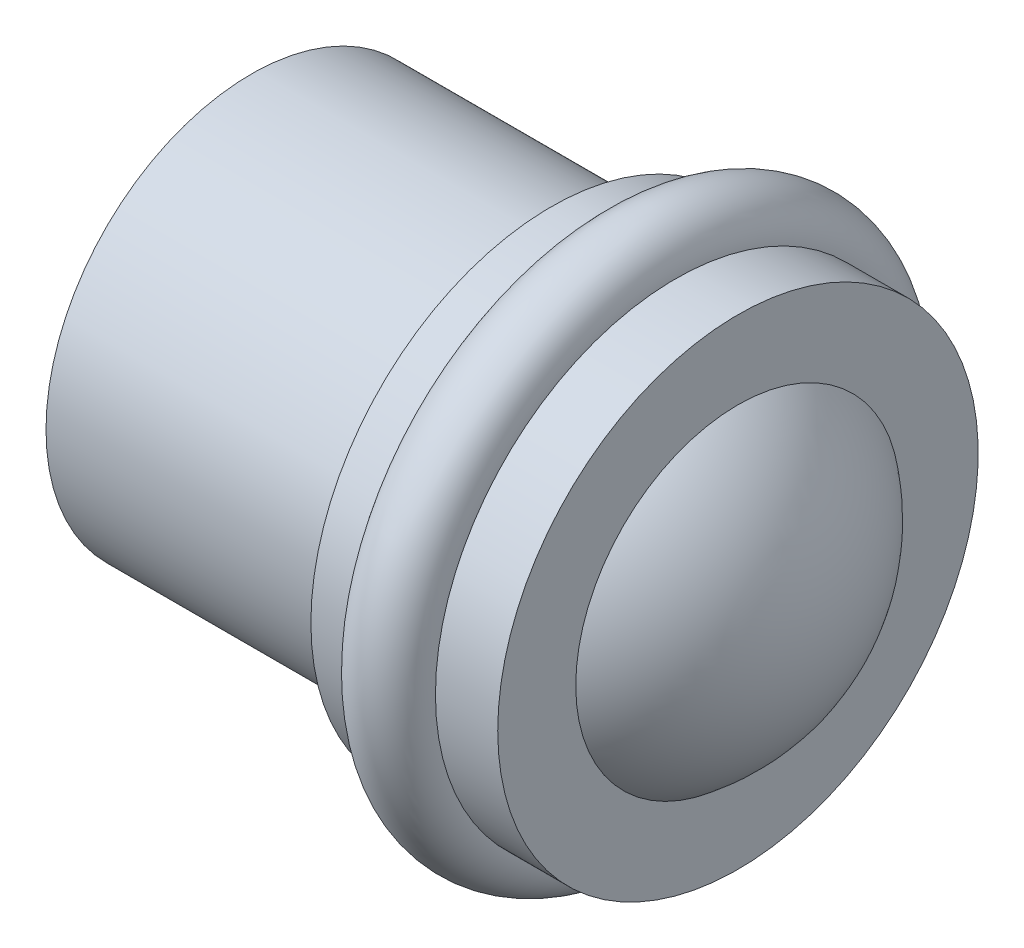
ISO-10303-21;
HEADER;
FILE_DESCRIPTION(('STEP AP214'),'2;1');
FILE_NAME('part.step','',(''),(''),'','','');
FILE_SCHEMA(('AUTOMOTIVE_DESIGN { 1 0 10303 214 1 1 1 1 }'));
ENDSEC;
DATA;
#1=APPLICATION_CONTEXT('core data for automotive mechanical design processes');
#2=APPLICATION_PROTOCOL_DEFINITION('international standard','automotive_design',2000,#1);
#3=PRODUCT_CONTEXT('',#1,'mechanical');
#4=PRODUCT('Part','Part','',(#3));
#5=PRODUCT_RELATED_PRODUCT_CATEGORY('part','',(#4));
#6=PRODUCT_DEFINITION_FORMATION('','',#4);
#7=PRODUCT_DEFINITION_CONTEXT('part definition',#1,'design');
#8=PRODUCT_DEFINITION('design','',#6,#7);
#9=PRODUCT_DEFINITION_SHAPE('','',#8);
#10=(LENGTH_UNIT() NAMED_UNIT(*) SI_UNIT(.MILLI.,.METRE.));
#11=(NAMED_UNIT(*) PLANE_ANGLE_UNIT() SI_UNIT($,.RADIAN.));
#12=(NAMED_UNIT(*) SI_UNIT($,.STERADIAN.) SOLID_ANGLE_UNIT());
#13=UNCERTAINTY_MEASURE_WITH_UNIT(LENGTH_MEASURE(1.E-05),#10,'distance_accuracy_value','');
#14=(GEOMETRIC_REPRESENTATION_CONTEXT(3) GLOBAL_UNCERTAINTY_ASSIGNED_CONTEXT((#13)) GLOBAL_UNIT_ASSIGNED_CONTEXT((#10,
#11,#12)) REPRESENTATION_CONTEXT('',''));
#15=CARTESIAN_POINT('',(0.,0.,0.));
#16=DIRECTION('',(0.,0.,1.));
#17=DIRECTION('',(1.,0.,0.));
#18=AXIS2_PLACEMENT_3D('',#15,#16,#17);
#19=CARTESIAN_POINT('',(1.26259166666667,0.,0.));
#20=DIRECTION('',(-1.,0.,0.));
#21=DIRECTION('',(0.,0.,1.));
#22=AXIS2_PLACEMENT_3D('',#19,#20,#21);
#23=TOROIDAL_SURFACE('',#22,2.97179999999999,0.481541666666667);
#24=CARTESIAN_POINT('',(1.26259166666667,0.,3.45334166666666));
#25=VERTEX_POINT('',#24);
#26=VERTEX_LOOP('',#25);
#27=FACE_BOUND('',#26,.T.);
#28=ADVANCED_FACE('F43',(#27),#23,.T.);
#29=CLOSED_SHELL('',(#28));
#30=MANIFOLD_SOLID_BREP('B2',#29);
#31=CARTESIAN_POINT('',(-3.5052,0.,0.));
#32=DIRECTION('',(1.,0.,0.));
#33=DIRECTION('',(0.,0.,-1.));
#34=AXIS2_PLACEMENT_3D('',#31,#32,#33);
#35=PLANE('',#34);
#36=CARTESIAN_POINT('',(-3.5052,0.,0.));
#37=DIRECTION('',(-1.,0.,0.));
#38=DIRECTION('',(0.,0.,1.));
#39=AXIS2_PLACEMENT_3D('',#36,#37,#38);
#40=CIRCLE('',#39,2.53999999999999);
#41=CARTESIAN_POINT('',(-3.5052,0.,2.53999999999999));
#42=VERTEX_POINT('',#41);
#43=EDGE_CURVE('E42',#42,#42,#40,.T.);
#44=ORIENTED_EDGE('',*,*,#43,.T.);
#45=EDGE_LOOP('',(#44));
#46=FACE_BOUND('',#45,.T.);
#47=ADVANCED_FACE('F56',(#46),#35,.F.);
#48=CARTESIAN_POINT('',(-3.5052,0.,0.));
#49=DIRECTION('',(-1.,0.,0.));
#50=DIRECTION('',(0.,0.,1.));
#51=AXIS2_PLACEMENT_3D('',#48,#49,#50);
#52=CYLINDRICAL_SURFACE('',#51,2.53999999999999);
#53=ORIENTED_EDGE('',*,*,#43,.F.);
#54=EDGE_LOOP('',(#53));
#55=FACE_BOUND('',#54,.T.);
#56=CARTESIAN_POINT('',(0.203200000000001,0.,0.));
#57=DIRECTION('',(-1.,0.,0.));
#58=DIRECTION('',(0.,0.,1.));
#59=AXIS2_PLACEMENT_3D('',#56,#57,#58);
#60=CIRCLE('',#59,2.53999999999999);
#61=CARTESIAN_POINT('',(0.203200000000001,0.,2.53999999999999));
#62=VERTEX_POINT('',#61);
#63=EDGE_CURVE('E63',#62,#62,#60,.T.);
#64=ORIENTED_EDGE('',*,*,#63,.T.);
#65=EDGE_LOOP('',(#64));
#66=FACE_BOUND('',#65,.T.);
#67=ADVANCED_FACE('F104',(#55,#66),#52,.T.);
#68=CARTESIAN_POINT('',(0.2032,2.54,0.));
#69=DIRECTION('',(1.,0.,0.));
#70=DIRECTION('',(0.,0.,-1.));
#71=AXIS2_PLACEMENT_3D('',#68,#69,#70);
#72=PLANE('',#71);
#73=ORIENTED_EDGE('',*,*,#63,.F.);
#74=EDGE_LOOP('',(#73));
#75=FACE_BOUND('',#74,.T.);
#76=CARTESIAN_POINT('',(0.203200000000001,0.,0.));
#77=DIRECTION('',(-1.,0.,0.));
#78=DIRECTION('',(0.,0.,1.));
#79=AXIS2_PLACEMENT_3D('',#76,#77,#78);
#80=CIRCLE('',#79,2.97179999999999);
#81=CARTESIAN_POINT('',(0.203200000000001,0.,2.97179999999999));
#82=VERTEX_POINT('',#81);
#83=EDGE_CURVE('E69',#82,#82,#80,.T.);
#84=ORIENTED_EDGE('',*,*,#83,.T.);
#85=EDGE_LOOP('',(#84));
#86=FACE_BOUND('',#85,.T.);
#87=ADVANCED_FACE('F108',(#75,#86),#72,.F.);
#88=CARTESIAN_POINT('',(-3.5052,0.,0.));
#89=DIRECTION('',(-1.,0.,0.));
#90=DIRECTION('',(0.,0.,1.));
#91=AXIS2_PLACEMENT_3D('',#88,#89,#90);
#92=CYLINDRICAL_SURFACE('',#91,2.97179999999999);
#93=ORIENTED_EDGE('',*,*,#83,.F.);
#94=EDGE_LOOP('',(#93));
#95=FACE_BOUND('',#94,.T.);
#96=CARTESIAN_POINT('',(0.78105,0.,0.));
#97=DIRECTION('',(-1.,0.,0.));
#98=DIRECTION('',(0.,0.,1.));
#99=AXIS2_PLACEMENT_3D('',#96,#97,#98);
#100=CIRCLE('',#99,2.97179999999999);
#101=CARTESIAN_POINT('',(0.78105,0.,2.97179999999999));
#102=VERTEX_POINT('',#101);
#103=EDGE_CURVE('E75',#102,#102,#100,.T.);
#104=ORIENTED_EDGE('',*,*,#103,.T.);
#105=EDGE_LOOP('',(#104));
#106=FACE_BOUND('',#105,.T.);
#107=ADVANCED_FACE('F113',(#95,#106),#92,.T.);
#108=CARTESIAN_POINT('',(1.26259166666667,0.,0.));
#109=DIRECTION('',(-1.,0.,0.));
#110=DIRECTION('',(0.,0.,1.));
#111=AXIS2_PLACEMENT_3D('',#108,#109,#110);
#112=TOROIDAL_SURFACE('',#111,2.97179999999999,0.481541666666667);
#113=ORIENTED_EDGE('',*,*,#103,.F.);
#114=EDGE_LOOP('',(#113));
#115=FACE_BOUND('',#114,.T.);
#116=CARTESIAN_POINT('',(1.74413333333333,0.,0.));
#117=DIRECTION('',(-1.,0.,0.));
#118=DIRECTION('',(0.,0.,1.));
#119=AXIS2_PLACEMENT_3D('',#116,#117,#118);
#120=CIRCLE('',#119,2.97179999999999);
#121=CARTESIAN_POINT('',(1.74413333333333,0.,2.97179999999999));
#122=VERTEX_POINT('',#121);
#123=EDGE_CURVE('E81',#122,#122,#120,.T.);
#124=ORIENTED_EDGE('',*,*,#123,.T.);
#125=EDGE_LOOP('',(#124));
#126=FACE_BOUND('',#125,.T.);
#127=ADVANCED_FACE('F119',(#115,#126),#112,.F.);
#128=CARTESIAN_POINT('',(-3.5052,0.,0.));
#129=DIRECTION('',(-1.,0.,0.));
#130=DIRECTION('',(0.,0.,1.));
#131=AXIS2_PLACEMENT_3D('',#128,#129,#130);
#132=CYLINDRICAL_SURFACE('',#131,2.97179999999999);
#133=ORIENTED_EDGE('',*,*,#123,.F.);
#134=EDGE_LOOP('',(#133));
#135=FACE_BOUND('',#134,.T.);
#136=CARTESIAN_POINT('',(2.5146,0.,0.));
#137=DIRECTION('',(-1.,0.,0.));
#138=DIRECTION('',(0.,0.,1.));
#139=AXIS2_PLACEMENT_3D('',#136,#137,#138);
#140=CIRCLE('',#139,2.97179999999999);
#141=CARTESIAN_POINT('',(2.5146,0.,2.97179999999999));
#142=VERTEX_POINT('',#141);
#143=EDGE_CURVE('E85',#142,#142,#140,.T.);
#144=ORIENTED_EDGE('',*,*,#143,.T.);
#145=EDGE_LOOP('',(#144));
#146=FACE_BOUND('',#145,.T.);
#147=ADVANCED_FACE('F100',(#135,#146),#132,.T.);
#148=CARTESIAN_POINT('',(2.5146,2.9718,0.));
#149=DIRECTION('',(-1.,0.,0.));
#150=DIRECTION('',(0.,0.,1.));
#151=AXIS2_PLACEMENT_3D('',#148,#149,#150);
#152=PLANE('',#151);
#153=ORIENTED_EDGE('',*,*,#143,.F.);
#154=EDGE_LOOP('',(#153));
#155=FACE_BOUND('',#154,.T.);
#156=CARTESIAN_POINT('',(2.5146,0.,0.));
#157=DIRECTION('',(-1.,0.,0.));
#158=DIRECTION('',(0.,0.,1.));
#159=AXIS2_PLACEMENT_3D('',#156,#157,#158);
#160=CIRCLE('',#159,2.00659999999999);
#161=CARTESIAN_POINT('',(2.5146,0.,2.00659999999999));
#162=VERTEX_POINT('',#161);
#163=EDGE_CURVE('E88',#162,#162,#160,.T.);
#164=ORIENTED_EDGE('',*,*,#163,.T.);
#165=EDGE_LOOP('',(#164));
#166=FACE_BOUND('',#165,.T.);
#167=ADVANCED_FACE('F92',(#155,#166),#152,.F.);
#168=CARTESIAN_POINT('',(0.977574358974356,0.,0.));
#169=DIRECTION('',(-1.,0.,0.));
#170=DIRECTION('',(0.,1.,0.));
#171=AXIS2_PLACEMENT_3D('',#168,#169,#170);
#172=SPHERICAL_SURFACE('',#171,2.52762564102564);
#173=ORIENTED_EDGE('',*,*,#163,.F.);
#174=EDGE_LOOP('',(#173));
#175=FACE_BOUND('',#174,.T.);
#176=ADVANCED_FACE('F94',(#175),#172,.T.);
#177=CLOSED_SHELL('',(#47,#67,#87,#107,#127,#147,#167,#176));
#178=MANIFOLD_SOLID_BREP('B6',#177);
#179=ADVANCED_BREP_SHAPE_REPRESENTATION('',(#18,#30,#178),#14);
#180=SHAPE_DEFINITION_REPRESENTATION(#9,#179);
ENDSEC;
END-ISO-10303-21;
